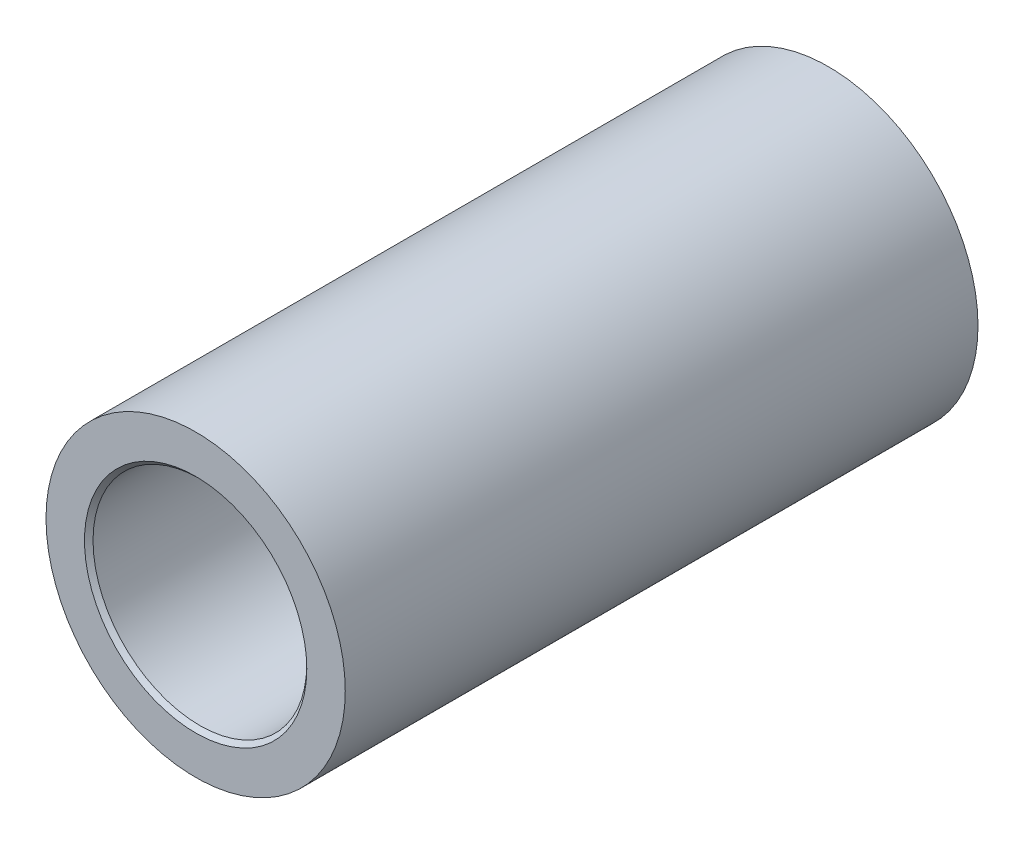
from build123d import *

# Parameters (mm, degrees)
ESQUISSE1_R      = 17.5
ESQUISSE1_R_2    = 12.5
EXTRUSION1_DEPTH = 74
CHANFREIN1_SIZE  = 0.5


with BuildPart() as part:
    # Esquisse1 → Extrusion1 (new body)
    with BuildSketch(Plane.XY):
        Circle(ESQUISSE1_R)
        Circle(ESQUISSE1_R_2, mode=Mode.SUBTRACT)
    extrude(amount=EXTRUSION1_DEPTH)

    # Chanfrein1
    chanfrein1_edges = [part.edges().sort_by_distance(p)[0] for p in [
        (-12.5, 0, 0),
        (-12.5, 0, 74),
    ]]
    chamfer(chanfrein1_edges, length=CHANFREIN1_SIZE)


solid = part.part
